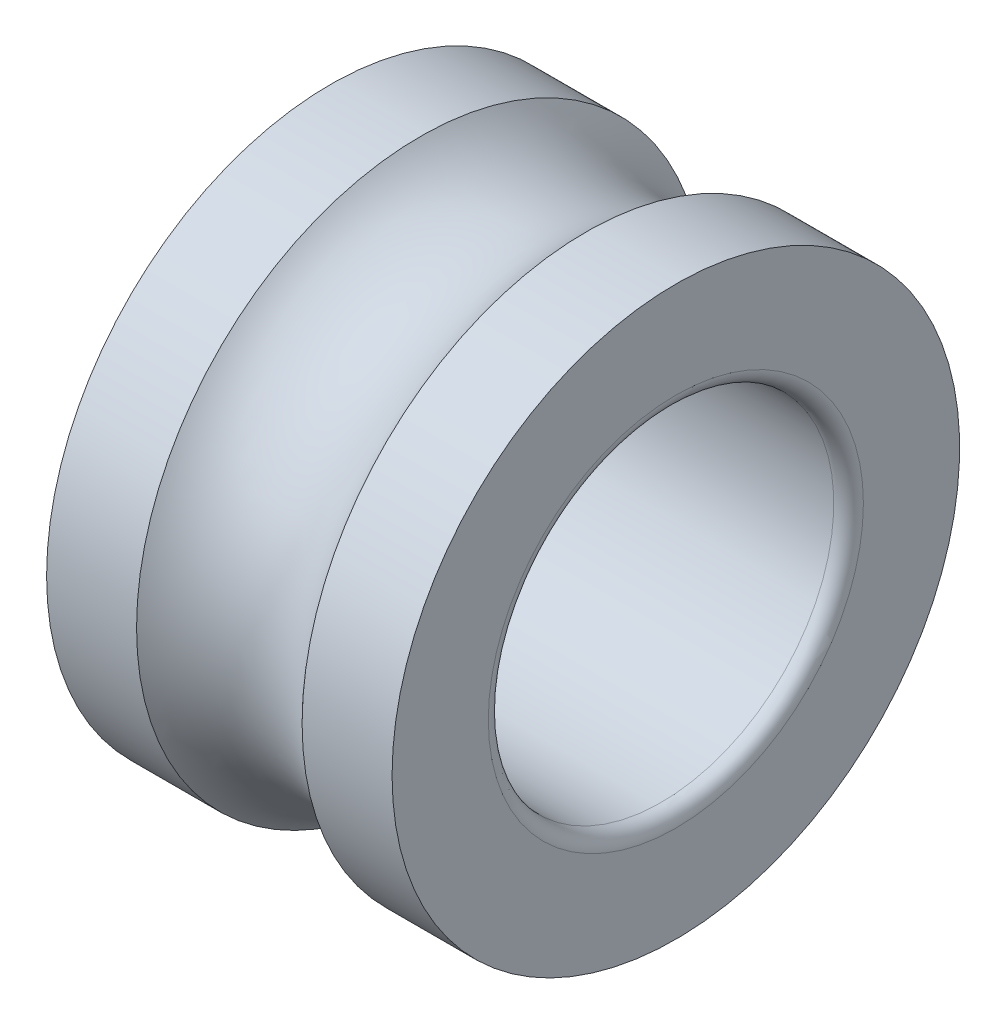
ISO-10303-21;
HEADER;
FILE_DESCRIPTION(('STEP AP214'),'2;1');
FILE_NAME('part.step','',(''),(''),'','','');
FILE_SCHEMA(('AUTOMOTIVE_DESIGN { 1 0 10303 214 1 1 1 1 }'));
ENDSEC;
DATA;
#1=APPLICATION_CONTEXT('core data for automotive mechanical design processes');
#2=APPLICATION_PROTOCOL_DEFINITION('international standard','automotive_design',2000,#1);
#3=PRODUCT_CONTEXT('',#1,'mechanical');
#4=PRODUCT('Part','Part','',(#3));
#5=PRODUCT_RELATED_PRODUCT_CATEGORY('part','',(#4));
#6=PRODUCT_DEFINITION_FORMATION('','',#4);
#7=PRODUCT_DEFINITION_CONTEXT('part definition',#1,'design');
#8=PRODUCT_DEFINITION('design','',#6,#7);
#9=PRODUCT_DEFINITION_SHAPE('','',#8);
#10=(LENGTH_UNIT() NAMED_UNIT(*) SI_UNIT(.MILLI.,.METRE.));
#11=(NAMED_UNIT(*) PLANE_ANGLE_UNIT() SI_UNIT($,.RADIAN.));
#12=(NAMED_UNIT(*) SI_UNIT($,.STERADIAN.) SOLID_ANGLE_UNIT());
#13=UNCERTAINTY_MEASURE_WITH_UNIT(LENGTH_MEASURE(1.E-05),#10,'distance_accuracy_value','');
#14=(GEOMETRIC_REPRESENTATION_CONTEXT(3) GLOBAL_UNCERTAINTY_ASSIGNED_CONTEXT((#13)) GLOBAL_UNIT_ASSIGNED_CONTEXT((#10,
#11,#12)) REPRESENTATION_CONTEXT('',''));
#15=CARTESIAN_POINT('',(0.,0.,0.));
#16=DIRECTION('',(0.,0.,1.));
#17=DIRECTION('',(1.,0.,0.));
#18=AXIS2_PLACEMENT_3D('',#15,#16,#17);
#19=CARTESIAN_POINT('',(0.300000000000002,0.,0.));
#20=DIRECTION('',(-1.,0.,0.));
#21=DIRECTION('',(0.,0.,1.));
#22=AXIS2_PLACEMENT_3D('',#19,#20,#21);
#23=TOROIDAL_SURFACE('',#22,3.8,0.300000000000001);
#24=CARTESIAN_POINT('',(0.300000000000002,0.,0.));
#25=DIRECTION('',(-1.,0.,0.));
#26=DIRECTION('',(0.,0.,1.));
#27=AXIS2_PLACEMENT_3D('',#24,#25,#26);
#28=CIRCLE('',#27,3.5);
#29=CARTESIAN_POINT('',(0.300000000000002,0.,3.5));
#30=VERTEX_POINT('',#29);
#31=EDGE_CURVE('E10',#30,#30,#28,.T.);
#32=ORIENTED_EDGE('',*,*,#31,.F.);
#33=EDGE_LOOP('',(#32));
#34=FACE_BOUND('',#33,.T.);
#35=CARTESIAN_POINT('',(0.,0.,0.));
#36=DIRECTION('',(-1.,0.,0.));
#37=DIRECTION('',(0.,0.,1.));
#38=AXIS2_PLACEMENT_3D('',#35,#36,#37);
#39=CIRCLE('',#38,3.8);
#40=CARTESIAN_POINT('',(0.,0.,3.8));
#41=VERTEX_POINT('',#40);
#42=EDGE_CURVE('E57',#41,#41,#39,.T.);
#43=ORIENTED_EDGE('',*,*,#42,.T.);
#44=EDGE_LOOP('',(#43));
#45=FACE_BOUND('',#44,.T.);
#46=ADVANCED_FACE('F29',(#34,#45),#23,.T.);
#47=CARTESIAN_POINT('',(0.,0.,0.));
#48=DIRECTION('',(-1.,0.,0.));
#49=DIRECTION('',(0.,0.,1.));
#50=AXIS2_PLACEMENT_3D('',#47,#48,#49);
#51=CYLINDRICAL_SURFACE('',#50,3.5);
#52=CARTESIAN_POINT('',(6.70000000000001,0.,0.));
#53=DIRECTION('',(-1.,0.,0.));
#54=DIRECTION('',(0.,0.,1.));
#55=AXIS2_PLACEMENT_3D('',#52,#53,#54);
#56=CIRCLE('',#55,3.5);
#57=CARTESIAN_POINT('',(6.70000000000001,0.,3.5));
#58=VERTEX_POINT('',#57);
#59=EDGE_CURVE('E35',#58,#58,#56,.T.);
#60=ORIENTED_EDGE('',*,*,#59,.F.);
#61=EDGE_LOOP('',(#60));
#62=FACE_BOUND('',#61,.T.);
#63=ORIENTED_EDGE('',*,*,#31,.T.);
#64=EDGE_LOOP('',(#63));
#65=FACE_BOUND('',#64,.T.);
#66=ADVANCED_FACE('F94',(#62,#65),#51,.F.);
#67=CARTESIAN_POINT('',(6.70000000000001,0.,0.));
#68=DIRECTION('',(-1.,0.,0.));
#69=DIRECTION('',(0.,0.,1.));
#70=AXIS2_PLACEMENT_3D('',#67,#68,#69);
#71=TOROIDAL_SURFACE('',#70,3.8,0.300000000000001);
#72=CARTESIAN_POINT('',(7.00000000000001,0.,0.));
#73=DIRECTION('',(-1.,0.,0.));
#74=DIRECTION('',(0.,0.,1.));
#75=AXIS2_PLACEMENT_3D('',#72,#73,#74);
#76=CIRCLE('',#75,3.8);
#77=CARTESIAN_POINT('',(7.00000000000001,0.,3.8));
#78=VERTEX_POINT('',#77);
#79=EDGE_CURVE('E39',#78,#78,#76,.T.);
#80=ORIENTED_EDGE('',*,*,#79,.F.);
#81=EDGE_LOOP('',(#80));
#82=FACE_BOUND('',#81,.T.);
#83=ORIENTED_EDGE('',*,*,#59,.T.);
#84=EDGE_LOOP('',(#83));
#85=FACE_BOUND('',#84,.T.);
#86=ADVANCED_FACE('F89',(#82,#85),#71,.T.);
#87=CARTESIAN_POINT('',(7.,0.,-5.75));
#88=DIRECTION('',(-1.,0.,0.));
#89=DIRECTION('',(0.,0.,1.));
#90=AXIS2_PLACEMENT_3D('',#87,#88,#89);
#91=PLANE('',#90);
#92=CARTESIAN_POINT('',(7.,0.,0.));
#93=DIRECTION('',(-1.,0.,0.));
#94=DIRECTION('',(0.,0.,1.));
#95=AXIS2_PLACEMENT_3D('',#92,#93,#94);
#96=CIRCLE('',#95,5.75);
#97=CARTESIAN_POINT('',(7.,0.,5.75));
#98=VERTEX_POINT('',#97);
#99=EDGE_CURVE('E43',#98,#98,#96,.T.);
#100=ORIENTED_EDGE('',*,*,#99,.F.);
#101=EDGE_LOOP('',(#100));
#102=FACE_BOUND('',#101,.T.);
#103=ORIENTED_EDGE('',*,*,#79,.T.);
#104=EDGE_LOOP('',(#103));
#105=FACE_BOUND('',#104,.T.);
#106=ADVANCED_FACE('F83',(#102,#105),#91,.F.);
#107=CARTESIAN_POINT('',(0.,0.,0.));
#108=DIRECTION('',(-1.,0.,0.));
#109=DIRECTION('',(0.,0.,1.));
#110=AXIS2_PLACEMENT_3D('',#107,#108,#109);
#111=CYLINDRICAL_SURFACE('',#110,5.75);
#112=CARTESIAN_POINT('',(5.17705098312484,0.,0.));
#113=DIRECTION('',(-1.,0.,0.));
#114=DIRECTION('',(0.,0.,1.));
#115=AXIS2_PLACEMENT_3D('',#112,#113,#114);
#116=CIRCLE('',#115,5.75);
#117=CARTESIAN_POINT('',(5.17705098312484,0.,5.75));
#118=VERTEX_POINT('',#117);
#119=EDGE_CURVE('E48',#118,#118,#116,.T.);
#120=ORIENTED_EDGE('',*,*,#119,.F.);
#121=EDGE_LOOP('',(#120));
#122=FACE_BOUND('',#121,.T.);
#123=ORIENTED_EDGE('',*,*,#99,.T.);
#124=EDGE_LOOP('',(#123));
#125=FACE_BOUND('',#124,.T.);
#126=ADVANCED_FACE('F77',(#122,#125),#111,.T.);
#127=CARTESIAN_POINT('',(3.5,0.,0.));
#128=DIRECTION('',(-1.,0.,0.));
#129=DIRECTION('',(0.,0.,1.));
#130=AXIS2_PLACEMENT_3D('',#127,#128,#129);
#131=TOROIDAL_SURFACE('',#130,7.25,2.25);
#132=CARTESIAN_POINT('',(1.82294901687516,0.,0.));
#133=DIRECTION('',(-1.,0.,0.));
#134=DIRECTION('',(0.,0.,1.));
#135=AXIS2_PLACEMENT_3D('',#132,#133,#134);
#136=CIRCLE('',#135,5.75);
#137=CARTESIAN_POINT('',(1.82294901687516,0.,5.75));
#138=VERTEX_POINT('',#137);
#139=EDGE_CURVE('E51',#138,#138,#136,.T.);
#140=ORIENTED_EDGE('',*,*,#139,.F.);
#141=EDGE_LOOP('',(#140));
#142=FACE_BOUND('',#141,.T.);
#143=ORIENTED_EDGE('',*,*,#119,.T.);
#144=EDGE_LOOP('',(#143));
#145=FACE_BOUND('',#144,.T.);
#146=ADVANCED_FACE('F71',(#142,#145),#131,.F.);
#147=CARTESIAN_POINT('',(0.,0.,0.));
#148=DIRECTION('',(-1.,0.,0.));
#149=DIRECTION('',(0.,0.,1.));
#150=AXIS2_PLACEMENT_3D('',#147,#148,#149);
#151=CYLINDRICAL_SURFACE('',#150,5.75);
#152=CARTESIAN_POINT('',(0.,0.,0.));
#153=DIRECTION('',(-1.,0.,0.));
#154=DIRECTION('',(0.,0.,1.));
#155=AXIS2_PLACEMENT_3D('',#152,#153,#154);
#156=CIRCLE('',#155,5.75);
#157=CARTESIAN_POINT('',(0.,0.,5.75));
#158=VERTEX_POINT('',#157);
#159=EDGE_CURVE('E54',#158,#158,#156,.T.);
#160=ORIENTED_EDGE('',*,*,#159,.F.);
#161=EDGE_LOOP('',(#160));
#162=FACE_BOUND('',#161,.T.);
#163=ORIENTED_EDGE('',*,*,#139,.T.);
#164=EDGE_LOOP('',(#163));
#165=FACE_BOUND('',#164,.T.);
#166=ADVANCED_FACE('F65',(#162,#165),#151,.T.);
#167=CARTESIAN_POINT('',(0.,0.,-5.75));
#168=DIRECTION('',(1.,0.,0.));
#169=DIRECTION('',(0.,0.,-1.));
#170=AXIS2_PLACEMENT_3D('',#167,#168,#169);
#171=PLANE('',#170);
#172=ORIENTED_EDGE('',*,*,#42,.F.);
#173=EDGE_LOOP('',(#172));
#174=FACE_BOUND('',#173,.T.);
#175=ORIENTED_EDGE('',*,*,#159,.T.);
#176=EDGE_LOOP('',(#175));
#177=FACE_BOUND('',#176,.T.);
#178=ADVANCED_FACE('F62',(#174,#177),#171,.F.);
#179=CLOSED_SHELL('',(#46,#66,#86,#106,#126,#146,#166,#178));
#180=MANIFOLD_SOLID_BREP('B2',#179);
#181=ADVANCED_BREP_SHAPE_REPRESENTATION('',(#18,#180),#14);
#182=SHAPE_DEFINITION_REPRESENTATION(#9,#181);
ENDSEC;
END-ISO-10303-21;
